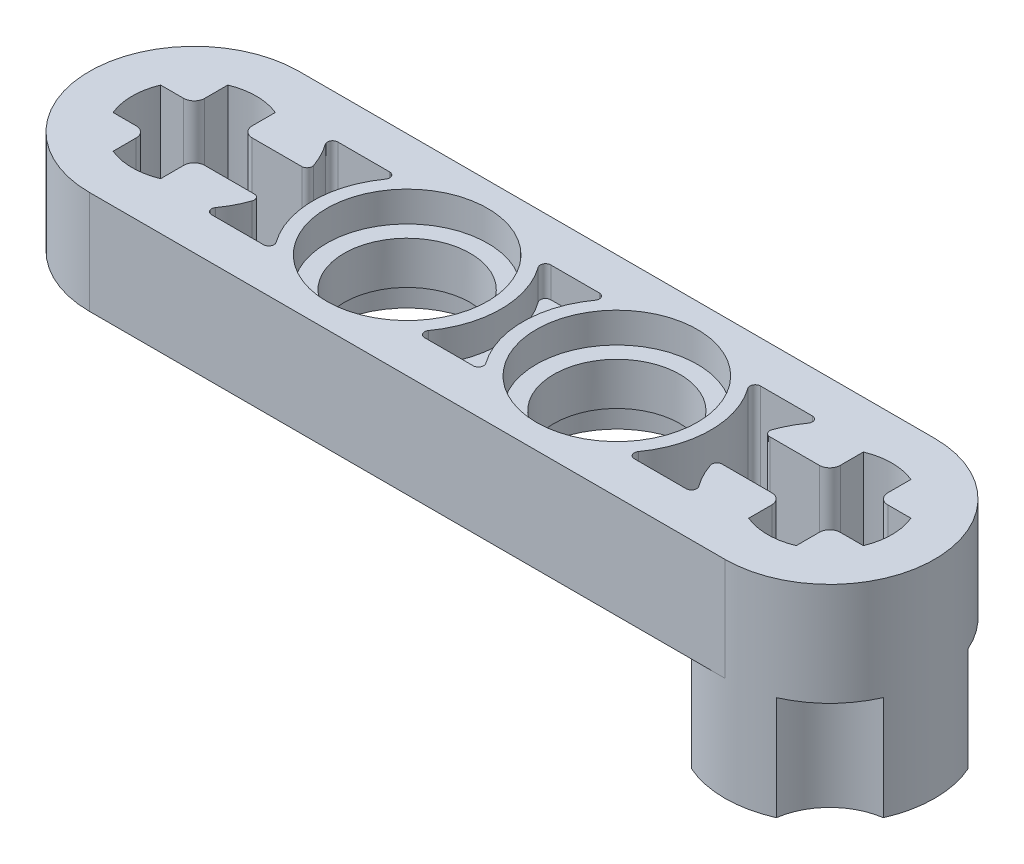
from build123d import *

# Parameters (mm, degrees)
BASE_EXTRUDE_DEPTH   = 1.95
SKETCH2_R            = 2.3876
CUT_EXTRUDE1_DEPTH   = 17.939922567
SKETCH3_R            = 3.048
CUT_EXTRUDE2_DEPTH   = 1.143
CUT_EXTRUDE3_START   = -1.143
SKETCH4_R            = 3.048
CUT_EXTRUDE3_DEPTH   = 1.143
LPATTERN1_COUNT      = 2
LPATTERN1_PITCH      = 7.9375
CUT_EXTRUDE4_DEPTH   = 17.939922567
FILLET1_R            = 0.396875
CUT_EXTRUDE5_DEPTH   = 17.939922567
FILLET2_R            = 0.1984375
FILLET1_OF_MIRROR1_R = 0.396875
FILLET2_OF_MIRROR1_R = 0.1984375
CUT_EXTRUDE6_DEPTH   = 1.143
FILLET3_R            = 0.1984375
FILLET3_OF_MIRROR2_R = 0.1984375
SKETCH8_R            = 3.96875
SKETCH8_R_2          = 2.3876
BOSS_EXTRUDE1_DEPTH  = 3.937
CUT_EXTRUDE7_START   = -3.937
SKETCH9_R            = 2.3876
CUT_EXTRUDE7_DEPTH   = 3.937
CIRPATTERN1_COUNT    = 4


with BuildPart() as part:
    # Sketch1 → Base-Extrude (new, symmetric)
    with BuildSketch(Plane(origin=(0, 0, 0), x_dir=(1, 0, 0), z_dir=(0, 1, 0))):
        with BuildLine():
            Line((-12.03125, 3.96875), (12.03125, 3.96875))
            ThreePointArc((12.03125, 3.96875), (16, 0), (12.03125, -3.96875))
            Line((12.03125, -3.96875), (-12.03125, -3.96875))
            ThreePointArc((-12.03125, -3.96875), (-16, 0), (-12.03125, 3.96875))
        make_face()
    extrude(amount=BASE_EXTRUDE_DEPTH, both=True)

    # Sketch2 → Cut-Extrude1 (cut, through all)
    with BuildSketch(Plane(origin=(0, 1.95, 0), x_dir=(-1, 0, 0), z_dir=(0, 1, 0))):
        with Locations(Location((3.96875, 0, 0), (0, 0, 90))):
            Circle(SKETCH2_R)
    cut_extrude1 = extrude(amount=-CUT_EXTRUDE1_DEPTH, mode=Mode.SUBTRACT)

    # Sketch3 → Cut-Extrude2 (cut)
    with BuildSketch(Plane(origin=(0, 1.95, 0), x_dir=(-1, 0, 0), z_dir=(0, 1, 0))):
        with Locations(Location((3.96875, 0, 0), (0, 0, 90))):
            Circle(SKETCH3_R)
    cut_extrude2 = extrude(amount=-CUT_EXTRUDE2_DEPTH, mode=Mode.SUBTRACT)

    # Sketch4 → Cut-Extrude3 (cut)
    with BuildSketch(Plane.XZ.offset(1.95).offset(CUT_EXTRUDE3_START)):
        with Locations(Location((-3.96875, 0, 0), (0, 0, 90))):
            Circle(SKETCH4_R)
    cut_extrude3 = extrude(amount=CUT_EXTRUDE3_DEPTH, mode=Mode.SUBTRACT)

    # LPattern1: Cut-Extrude1, Cut-Extrude2, Cut-Extrude3 ×2
    with Locations(*[(i * LPATTERN1_PITCH, 0, 0) for i in range(1, LPATTERN1_COUNT)]):
        add(cut_extrude1, mode=Mode.SUBTRACT)
        add(cut_extrude2, mode=Mode.SUBTRACT)
        add(cut_extrude3, mode=Mode.SUBTRACT)

    # Sketch5 → Cut-Extrude4 (cut, through all)
    with BuildSketch(Plane(origin=(0, 1.95, 0), x_dir=(-1, 0, 0), z_dir=(0, 1, 0))):
        with BuildLine():
            Line((11.13125, -2.170829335), (11.13125, -0.9))
            Line((11.13125, -0.9), (9.860420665, -0.9))
            ThreePointArc((9.860420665, -0.9), (9.68125, 0), (9.860420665, 0.9))
            Line((9.860420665, 0.9), (11.13125, 0.9))
            Line((11.13125, 0.9), (11.13125, 2.170829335))
            ThreePointArc((11.13125, 2.170829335), (12.03125, 2.35), (12.93125, 2.170829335))
            Line((12.93125, 2.170829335), (12.93125, 0.9))
            Line((12.93125, 0.9), (14.202079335, 0.9))
            ThreePointArc((14.202079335, 0.9), (14.38125, 0), (14.202079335, -0.9))
            Line((14.202079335, -0.9), (12.93125, -0.9))
            Line((12.93125, -0.9), (12.93125, -2.170829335))
            ThreePointArc((12.93125, -2.170829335), (12.03125, -2.35), (11.13125, -2.170829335))
        make_face()
    cut_extrude4 = extrude(amount=-CUT_EXTRUDE4_DEPTH, mode=Mode.SUBTRACT)

    # Fillet1
    fillet1_edges = [part.edges().sort_by_distance(p)[0] for p in [
        (-11.13125, 0, 0.9),
        (-12.93125, 0, 0.9),
        (-12.93125, 0, -0.9),
        (-11.13125, 0, -0.9),
    ]]
    fillet(fillet1_edges, radius=FILLET1_R)

    # Sketch6 → Cut-Extrude5 (cut, through all)
    with BuildSketch(Plane(origin=(0, 1.95, 0), x_dir=(-1, 0, 0), z_dir=(0, 1, 0))):
        with BuildLine():
            Line((9.396007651, -2.3876), (6.603992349, -2.3876))
            ThreePointArc((6.603992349, -2.3876), (7.52475, 0), (6.603992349, 2.3876))
            Line((6.603992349, 2.3876), (9.396007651, 2.3876))
            ThreePointArc((9.396007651, 2.3876), (8.903781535, 1.692358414), (8.591026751, 0.9))
            Line((8.591026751, 0.9), (9.860420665, 0.9))
            ThreePointArc((9.860420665, 0.9), (9.68125, 0), (9.860420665, -0.9))
            Line((9.860420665, -0.9), (8.591026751, -0.9))
            ThreePointArc((8.591026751, -0.9), (8.903781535, -1.692358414), (9.396007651, -2.3876))
        make_face()
    cut_extrude5 = extrude(amount=-CUT_EXTRUDE5_DEPTH, mode=Mode.SUBTRACT)

    # Fillet2
    fillet2_edges = [part.edges().sort_by_distance(p)[0] for p in [
        (-8.591026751, 0, -0.9),
        (-9.396007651, 0, -2.3876),
        (-6.603992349, 0, -2.3876),
        (-6.603992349, 0, 2.3876),
        (-9.396007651, 0, 2.3876),
        (-8.591026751, 0, 0.9),
    ]]
    fillet(fillet2_edges, radius=FILLET2_R)

    # Mirror1: Cut-Extrude4, Cut-Extrude5 across plane
    add(cut_extrude4.mirror(Plane(origin=(0, 0, 0), x_dir=(0, 0, 1), z_dir=(1, 0, 0))), mode=Mode.SUBTRACT)
    add(cut_extrude5.mirror(Plane(origin=(0, 0, 0), x_dir=(0, 0, 1), z_dir=(1, 0, 0))), mode=Mode.SUBTRACT)

    # Fillet1 of Mirror1
    fillet1_of_mirror1_edges = [part.edges().sort_by_distance(p)[0] for p in [
        (11.13125, 0, 0.9),
        (12.93125, 0, 0.9),
        (12.93125, 0, -0.9),
        (11.13125, 0, -0.9),
    ]]
    fillet(fillet1_of_mirror1_edges, radius=FILLET1_OF_MIRROR1_R)

    # Fillet2 of Mirror1
    fillet2_of_mirror1_edges = [part.edges().sort_by_distance(p)[0] for p in [
        (8.591026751, 0, -0.9),
        (9.396007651, 0, -2.3876),
        (6.603992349, 0, -2.3876),
        (6.603992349, 0, 2.3876),
        (9.396007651, 0, 2.3876),
        (8.591026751, 0, 0.9),
    ]]
    fillet(fillet2_of_mirror1_edges, radius=FILLET2_OF_MIRROR1_R)

    # Sketch7 → Cut-Extrude6 (cut)
    with BuildSketch(Plane(origin=(7.626637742, 1.95, -1.750590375), x_dir=(-1, 0, 0), z_dir=(0, 1, 0))):
        with BuildLine():
            Line((8.960145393, -0.637009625), (6.293130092, -0.637009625))
            ThreePointArc((6.293130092, -0.637009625), (7.213887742, 1.750590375), (6.293130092, 4.138190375))
            Line((6.293130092, 4.138190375), (8.960145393, 4.138190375))
            ThreePointArc((8.960145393, 4.138190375), (8.277552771, 3.030085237), (8.039387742, 1.750590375))
            ThreePointArc((8.039387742, 1.750590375), (8.277552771, 0.471095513), (8.960145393, -0.637009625))
        make_face()
    cut_extrude6 = extrude(amount=-CUT_EXTRUDE6_DEPTH, mode=Mode.SUBTRACT)

    # Fillet3
    fillet3_edges = [part.edges().sort_by_distance(p)[0] for p in [
        (-1.333507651, 1.3785, -2.3876),
        (1.333507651, 1.3785, -2.3876),
        (1.333507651, 1.3785, 2.3876),
        (-1.333507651, 1.3785, 2.3876),
    ]]
    fillet(fillet3_edges, radius=FILLET3_R)

    # Mirror2: Cut-Extrude6 across plane
    add(cut_extrude6.mirror(Plane.ZX), mode=Mode.SUBTRACT)

    # Fillet3 of Mirror2
    fillet3_of_mirror2_edges = [part.edges().sort_by_distance(p)[0] for p in [
        (-1.333507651, -1.3785, -2.3876),
        (1.333507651, -1.3785, -2.3876),
        (1.333507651, -1.3785, 2.3876),
        (-1.333507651, -1.3785, 2.3876),
    ]]
    fillet(fillet3_of_mirror2_edges, radius=FILLET3_OF_MIRROR2_R)

    # Sketch8 → Boss-Extrude1 (add)
    with BuildSketch(Plane.XZ.offset(1.95)):
        with Locations(Location((12.03125, 0, 0), (0, 0, 270))):
            Circle(SKETCH8_R)
        with Locations(Location((12.03125, 0, 0), (0, 0, 157.855264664))):
            Circle(SKETCH8_R_2, mode=Mode.SUBTRACT)
    extrude(amount=BOSS_EXTRUDE1_DEPTH)

    # Sketch9 → Cut-Extrude7 (cut)
    with BuildSketch(Plane.XZ.offset(5.887).offset(CUT_EXTRUDE7_START)):
        with Locations((16, -3.96875)):
            Circle(SKETCH9_R)
    cut_extrude7 = extrude(amount=CUT_EXTRUDE7_DEPTH, mode=Mode.SUBTRACT)

    # CirPattern1: Cut-Extrude7 ×4 about axis
    cirpattern1_axis = Axis((12.03125, 0, 0), (0, 1, 0))
    for i in range(1, CIRPATTERN1_COUNT):
        add(cut_extrude7.rotate(cirpattern1_axis, i * 360 / CIRPATTERN1_COUNT), mode=Mode.SUBTRACT)


solid = part.part
